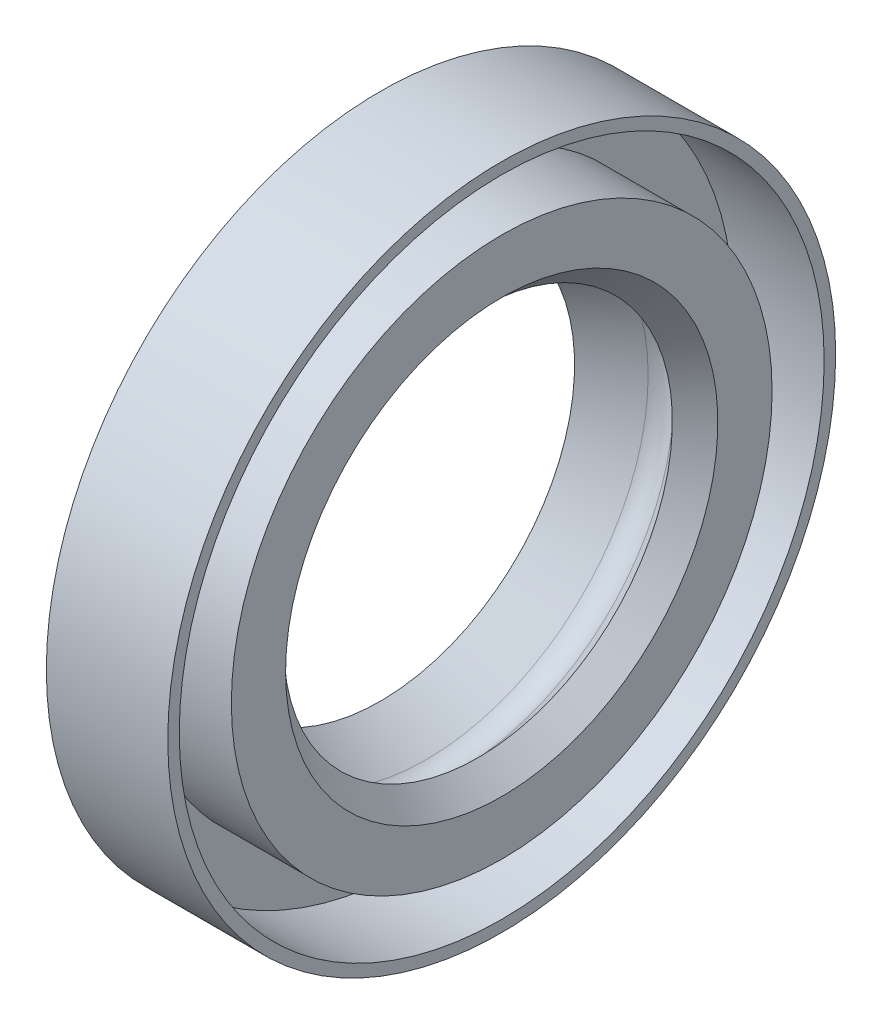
from build123d import *


with BuildPart() as part:
    # Esquisse1 → Base-R_volution (revolve)
    with BuildSketch(Plane.XY, mode=Mode.PRIVATE) as base_r_volution_sk:
        with BuildLine():
            Line((0, 19.541206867), (0, 27.5))
            Line((0, 27.5), (10, 27.5))
            Line((10, 27.5), (10, 26.553304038))
            Line((10, 26.553304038), (2.5, 26.553304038))
            Line((2.5, 26.553304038), (2.5, 22.264776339))
            Line((2.5, 22.264776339), (10, 22.264776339))
            Line((10, 22.264776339), (10, 17.798406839))
            Line((10, 17.798406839), (8.053531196, 16))
            Line((8.053531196, 16), (6.282104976, 17.917266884))
            ThreePointArc((6.282104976, 17.917266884), (5.095790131, 18.539952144), (3.782623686, 18.274106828))
            Line((3.782623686, 18.274106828), (0, 16))
            Line((0, 16), (0.828215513, 17.770949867))
            Line((0.828215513, 17.770949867), (0, 19.541206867))
        make_face()
    revolve(base_r_volution_sk.sketch.rotate(Axis((-2.053154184, 0, 0), (1, 0, 0)), 90), axis=Axis((-2.053154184, 0, 0), (1, 0, 0)))


solid = part.part
